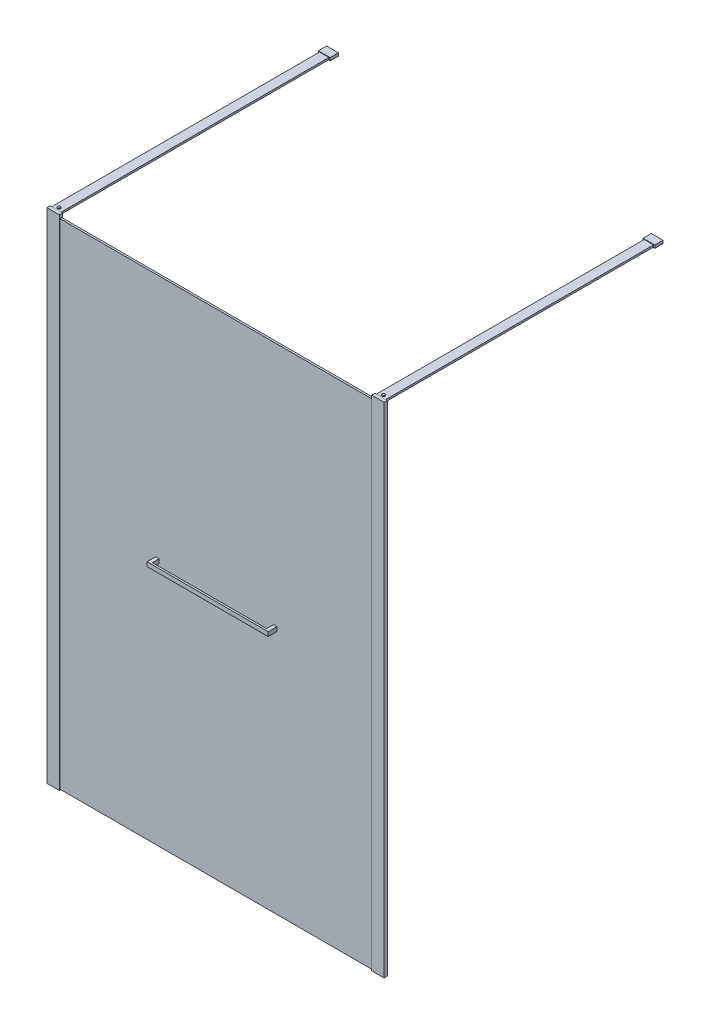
from build123d import *

# Parameters (mm, degrees)
DODANIE_WYCI_GNI_CIE1_START         = 3
DODANIE_WYCI_GNI_CIE1_DEPTH         = 2100
SZKIC2_W                            = 1347
SZKIC2_H                            = 8
DODANIE_WYCI_GNI_CIE2_DEPTH         = 2100
DODANIE_WYCI_GNI_CIE3_DEPTH         = 2100
SZKIC4_W                            = 53
SZKIC4_H                            = 14
DODANIE_WYCI_GNI_CIE4_DEPTH         = 16
SZKIC5_W                            = 53
SZKIC5_H                            = 14
DODANIE_WYCI_GNI_CIE5_DEPTH         = 16
SZKIC7_W                            = 53
SZKIC7_H                            = 14
DODANIE_WYCI_GNI_CIE7_DEPTH         = 3
SZKIC8_W                            = 53
SZKIC8_H                            = 14
DODANIE_WYCI_GNI_CIE8_DEPTH         = 3
SZKIC9_W                            = 40
SZKIC9_H                            = 8
DODANIE_WYCI_GNI_CIE9_DEPTH         = 1170
DODANIE_WYCI_GNI_CIE9_2_DEPTH       = 1170
DODANIE_WYCI_GNI_CIE10_START        = -32
SZKIC10_W                           = 50
SZKIC10_H                           = 12.5
DODANIE_WYCI_GNI_CIE10_DEPTH        = 35
DODANIE_WYCI_GNI_CIE11_DEPTH        = 36.5
DODANIE_WYCI_GNI_CIE11_DEPTH_BACK   = 18
SZKIC12_W                           = 15
SZKIC12_H                           = 18
DODANIE_WYCI_GNI_CIE11_2_DEPTH      = 36.5
DODANIE_WYCI_GNI_CIE11_2_DEPTH_BACK = 18
SZKIC13_W                           = 8
SZKIC13_H                           = 18
DODANIE_WYCI_GNI_CIE12_DEPTH        = 485


with BuildPart() as part:
    # Szkic1 → Dodanie-wyci_gni_cie1 (new body)
    with BuildSketch(Plane(origin=(0, 0, 0), x_dir=(1, 0, 0), z_dir=(0, 1, 0)).offset(DODANIE_WYCI_GNI_CIE1_START)):
        Polygon((0, 0), (0, 14), (53, 14), (53, 11), (42.9, 11), (42.9, 3), (53, 3), (53, 0), align=None)
    extrude(amount=DODANIE_WYCI_GNI_CIE1_DEPTH)

    # Szkic4 → Dodanie-wyci_gni_cie4 (add)
    with BuildSketch(Plane(origin=(0, 2103, 0), x_dir=(1, 0, 0), z_dir=(0, 1, 0))):
        with Locations((26.5, 7)):
            Rectangle(SZKIC4_W, SZKIC4_H)
    extrude(amount=DODANIE_WYCI_GNI_CIE4_DEPTH)

    # Szkic8 → Dodanie-wyci_gni_cie8 (add)
    with BuildSketch(Plane.XZ.offset(-3)):
        with Locations((26.5, -7)):
            Rectangle(SZKIC8_W, SZKIC8_H)
    extrude(amount=DODANIE_WYCI_GNI_CIE8_DEPTH)


with BuildPart() as body_2:
    # Szkic2 → Dodanie-wyci_gni_cie2 (new body)
    with BuildSketch(Plane.XZ.offset(-3)):
        with Locations((716.4, -7)):
            Rectangle(SZKIC2_W, SZKIC2_H)
    extrude(amount=-DODANIE_WYCI_GNI_CIE2_DEPTH)


with BuildPart() as body_3:
    # Szkic3 → Dodanie-wyci_gni_cie3 (new body)
    with BuildSketch(Plane.XZ.offset(-3)):
        Polygon((1379.8, -3), (1379.8, 0), (1432.8, 0), (1432.8, -14), (1379.8, -14), (1379.8, -11), (1389.9, -11), (1389.9, -3), align=None)
    extrude(amount=-DODANIE_WYCI_GNI_CIE3_DEPTH)

    # Szkic5 → Dodanie-wyci_gni_cie5 (add)
    with BuildSketch(Plane(origin=(0, 2103, 0), x_dir=(1, 0, 0), z_dir=(0, 1, 0))):
        with Locations((1406.3, 7)):
            Rectangle(SZKIC5_W, SZKIC5_H)
    extrude(amount=DODANIE_WYCI_GNI_CIE5_DEPTH)

    # Szkic7 → Dodanie-wyci_gni_cie7 (add)
    with BuildSketch(Plane.XZ.offset(-3)):
        with Locations((1406.3, -7)):
            Rectangle(SZKIC7_W, SZKIC7_H)
    extrude(amount=DODANIE_WYCI_GNI_CIE7_DEPTH)


with BuildPart() as body_4:
    # Szkic9 → Dodanie-wyci_gni_cie9 (new body)
    with BuildSketch(Plane(origin=(0, 0, -14), x_dir=(-1, 0, 0), z_dir=(0, 0, -1))):
        with Locations((-1406.3, 2115)):
            Rectangle(SZKIC9_W, SZKIC9_H)
    extrude(amount=DODANIE_WYCI_GNI_CIE9_DEPTH)



with BuildPart() as body_5:
    # Szkic9 → Dodanie-wyci_gni_cie9 2 (new body)
    with BuildSketch(Plane(origin=(0, 0, -14), x_dir=(-1, 0, 0), z_dir=(0, 0, -1))):
        with Locations((-26.5, 2115)):
            Rectangle(SZKIC9_W, SZKIC9_H)
    extrude(amount=DODANIE_WYCI_GNI_CIE9_2_DEPTH)


with BuildPart() as body_4_1:
    add(body_4.part)

    add(body_5.part)  # Dodanie-wyci_gni_cie10 merges body 5
    # Szkic10 → Dodanie-wyci_gni_cie10 (add)
    with BuildSketch(Plane(origin=(0, 0, -1184), x_dir=(-1, 0, 0), z_dir=(0, 0, -1)).offset(DODANIE_WYCI_GNI_CIE10_START)):
        with Locations((-1406.3, 2115)):
            Rectangle(SZKIC10_W, SZKIC10_H)
        with Locations((-26.5, 2115)):
            Rectangle(SZKIC10_W, SZKIC10_H)
    extrude(amount=DODANIE_WYCI_GNI_CIE10_DEPTH)

    # Szkic11 → Obr_t1 (revolve)
    with BuildSketch(Plane(origin=(1406.3, 0, 0), x_dir=(0, 0, -1), z_dir=(1, 0, 0))):
        with BuildLine():
            Line((29.9, 2119), (29.65, 2122.8))
            ThreePointArc((29.65, 2122.8), (26.98045718, 2124.212280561), (24, 2124.7))
            Line((24, 2124.7), (24, 2124.2))
            ThreePointArc((24, 2124.2), (26.713886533, 2123.773650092), (29.166308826, 2122.535676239))
            Line((29.166308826, 2122.535676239), (29.398919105, 2119))
            Line((29.398919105, 2119), (29.9, 2119))
        make_face()
    revolve(axis=Axis((1406.3, 2119, -24), (0, 1, 0)))

    # Szkic14 → Obr_t2 (revolve)
    with BuildSketch(Plane(origin=(26.5, 0, 0), x_dir=(0, 0, -1), z_dir=(1, 0, 0))):
        with BuildLine():
            Line((29.9, 2119), (29.65, 2122.8))
            ThreePointArc((29.65, 2122.8), (26.98045718, 2124.212280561), (24, 2124.7))
            Line((24, 2124.7), (24, 2124.2))
            ThreePointArc((24, 2124.2), (26.713886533, 2123.773650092), (29.166308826, 2122.535676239))
            Line((29.166308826, 2122.535676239), (29.398919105, 2119))
            Line((29.398919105, 2119), (29.9, 2119))
        make_face()
    revolve(axis=Axis((26.5, 2119, -24), (0, 1, 0)))


with BuildPart() as body_5_2:
    # Szkic12 → Dodanie-wyci_gni_cie11 (new, two sides: drawn at the far end of the back side and taken through both)
    with BuildSketch(Plane.XY.offset(-3).offset(-DODANIE_WYCI_GNI_CIE11_DEPTH_BACK)):
        with Locations((466.4, 1053)):
            Rectangle(SZKIC12_W, SZKIC12_H)
    extrude(amount=DODANIE_WYCI_GNI_CIE11_DEPTH + DODANIE_WYCI_GNI_CIE11_DEPTH_BACK)



with BuildPart() as body_6:
    # Szkic12 → Dodanie-wyci_gni_cie11 2 (new, two sides: drawn at the far end of the back side and taken through both)
    with BuildSketch(Plane.XY.offset(-3).offset(-DODANIE_WYCI_GNI_CIE11_2_DEPTH_BACK)):
        with Locations((966.4, 1053)):
            Rectangle(SZKIC12_W, SZKIC12_H)
    extrude(amount=DODANIE_WYCI_GNI_CIE11_2_DEPTH + DODANIE_WYCI_GNI_CIE11_2_DEPTH_BACK)


with BuildPart() as body_5_2_1:
    add(body_5_2.part)

    add(body_6.part)  # Dodanie-wyci_gni_cie12 merges body 6
    # Szkic13 → Dodanie-wyci_gni_cie12 (add)
    with BuildSketch(Plane(origin=(473.9, 0, 0), x_dir=(0, 0, -1), z_dir=(1, 0, 0))):
        with Locations((-29.5, 1053)):
            Rectangle(SZKIC13_W, SZKIC13_H)
    extrude(amount=DODANIE_WYCI_GNI_CIE12_DEPTH)


solid = Compound([part.part, body_2.part, body_3.part, body_4_1.part, body_5_2_1.part])
